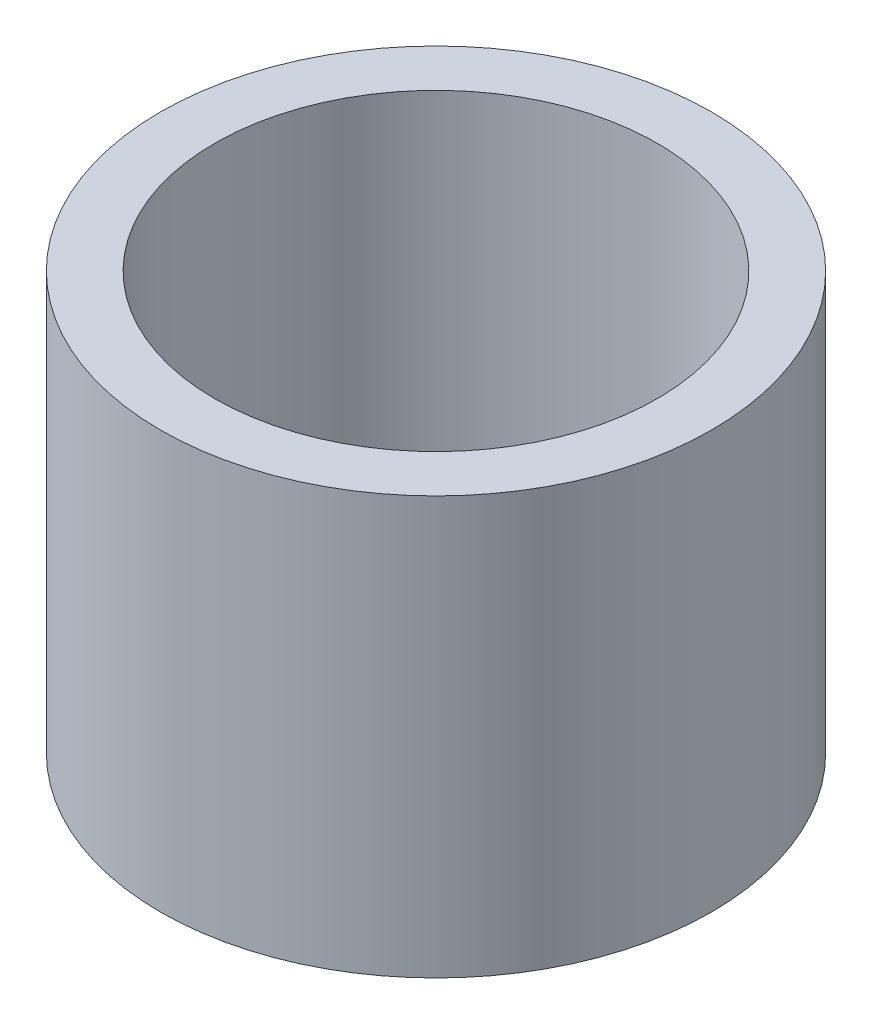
from build123d import *

# Parameters (mm, degrees)
SKETCH1_R           = 3.3
SKETCH1_R_2         = 2.65
BOSS_EXTRUDE1_DEPTH = 5


with BuildPart() as part:
    # Sketch1 → Boss-Extrude1 (new body)
    with BuildSketch(Plane(origin=(0, 0, 0), x_dir=(1, 0, 0), z_dir=(0, 1, 0))):
        with Locations(Location((0, 0, 0), (0, 0, 270))):
            Circle(SKETCH1_R)
        with Locations(Location((0, 0, 0), (0, 0, 270))):
            Circle(SKETCH1_R_2, mode=Mode.SUBTRACT)
    extrude(amount=BOSS_EXTRUDE1_DEPTH)


solid = part.part
